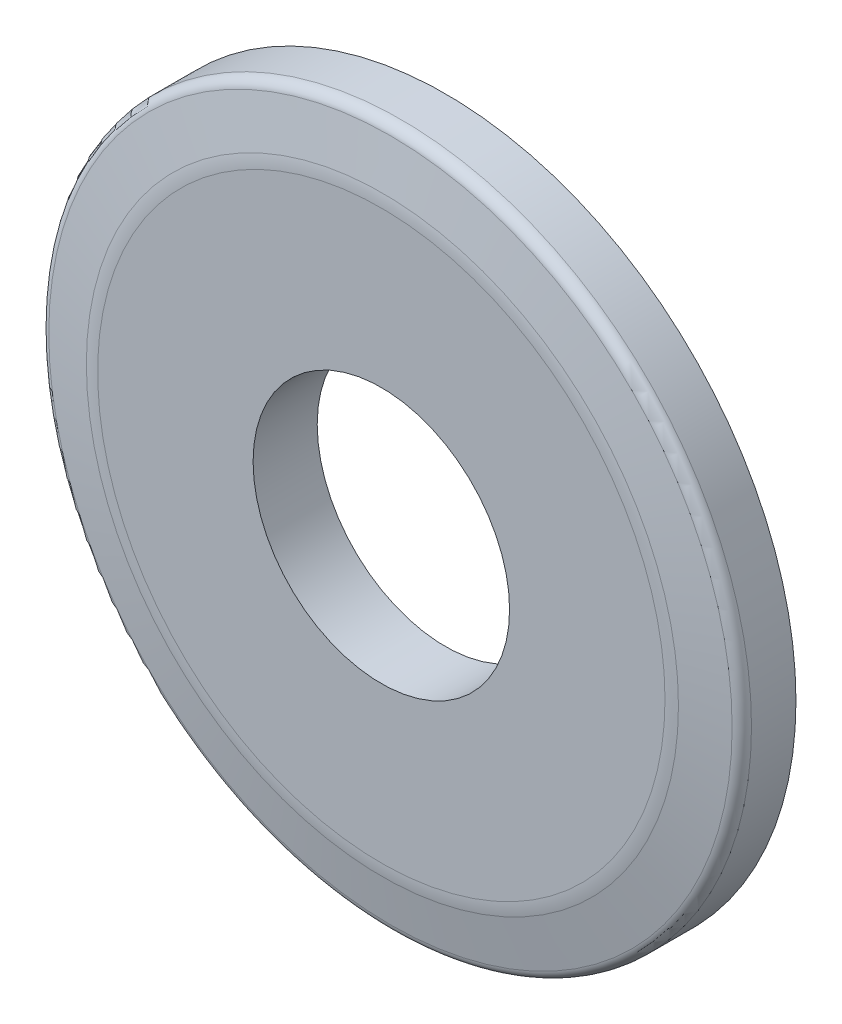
from build123d import *

# Parameters (mm, degrees)
SKETCH1_R      = 24.9936
SKETCH1_R_2    = 9.144
EXTRUDE1_DEPTH = 4.572
CHAMFER1_SIZE  = 0.762
CHAMFER1_SIZE2 = 4.321516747
FILLET1_R      = 0.762
FILLET2_R      = 5.08


with BuildPart() as part:
    # Sketch1 → Extrude1 (new body)
    with BuildSketch(Plane.XY):
        Circle(SKETCH1_R)
        Circle(SKETCH1_R_2, mode=Mode.SUBTRACT)
    extrude(amount=EXTRUDE1_DEPTH)

    # Chamfer1
    chamfer1_edges = [part.edges().sort_by_distance(p)[0] for p in [
        (-24.9936, 0, 4.572),
    ]]
    chamfer1_side = [part.faces().sort_by_distance(p)[0] for p in [
        (-24.9936, 0, 2.286),
    ]]
    chamfer(chamfer1_edges, length=CHAMFER1_SIZE, length2=CHAMFER1_SIZE2, reference=chamfer1_side[0])

    # Fillet1
    fillet1_edges = [part.edges().sort_by_distance(p)[0] for p in [
        (-24.9936, 0, 3.81),
    ]]
    fillet(fillet1_edges, radius=FILLET1_R)

    # Fillet2
    fillet2_edges = [part.edges().sort_by_distance(p)[0] for p in [
        (-20.672083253, 0, 4.572),
    ]]
    fillet(fillet2_edges, radius=FILLET2_R)


solid = part.part
